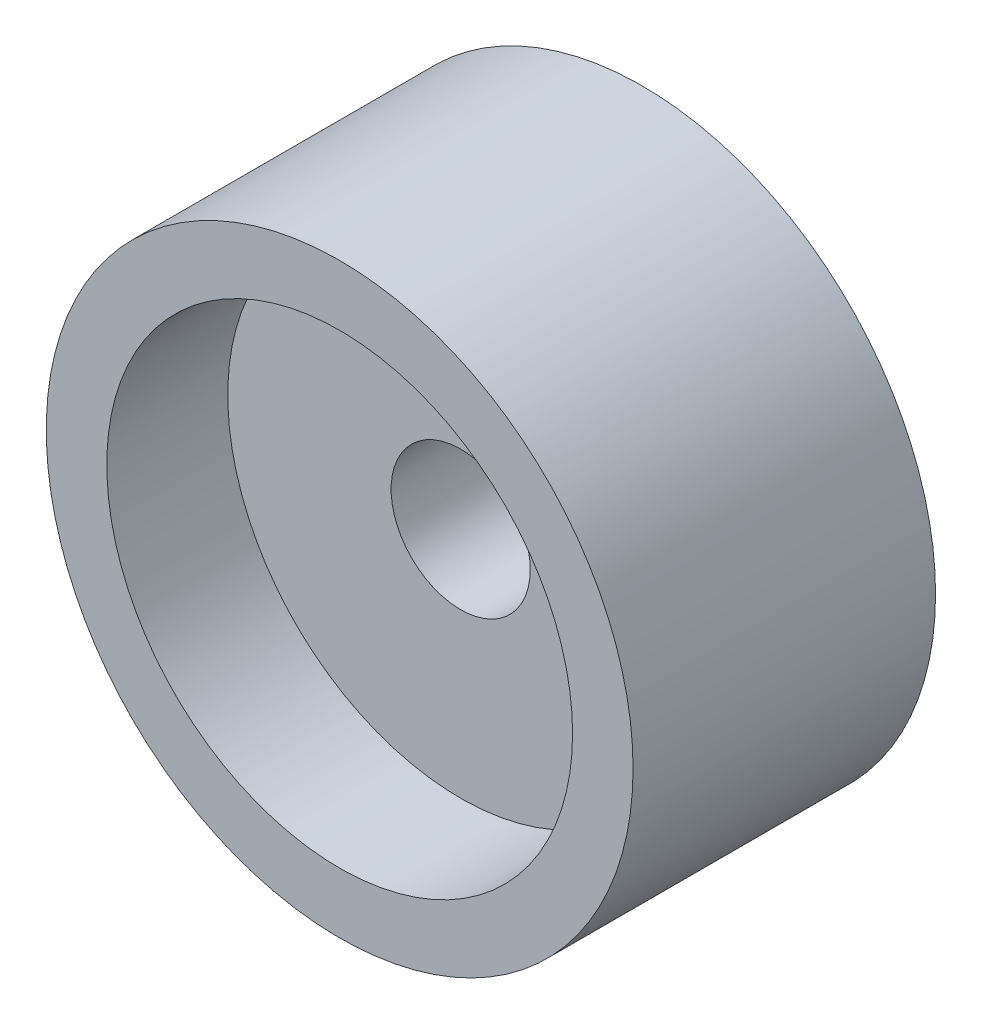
from build123d import *

# Parameters (mm, degrees)
SKETCH1_R           = 4.85
SKETCH1_R_2         = 3.85
BOSS_EXTRUDE1_DEPTH = 2
BOSS_EXTRUDE2_START = -3
SKETCH1_3_R         = 4.85
SKETCH1_3_R_2       = 3.85
SKETCH1_3_R_3       = 1.15
BOSS_EXTRUDE2_DEPTH = 3


with BuildPart() as part:
    # Sketch1 → Boss-Extrude1 (new body)
    with BuildSketch(Plane.XY):
        Circle(SKETCH1_R)
        Circle(SKETCH1_R_2, mode=Mode.SUBTRACT)
    extrude(amount=BOSS_EXTRUDE1_DEPTH)

    # Sketch1_3 → Boss-Extrude2 (add)
    # profile 1 of 2: a face of its own
    with BuildSketch(Plane.XY.offset(BOSS_EXTRUDE2_START)):
        Circle(SKETCH1_3_R)
        Circle(SKETCH1_3_R_2, mode=Mode.SUBTRACT)
    # profile 2 of 2: a face of its own
    with BuildSketch(Plane.XY.offset(BOSS_EXTRUDE2_START)):
        Circle(SKETCH1_3_R_2)
        Circle(SKETCH1_3_R_3, mode=Mode.SUBTRACT)
    extrude(amount=BOSS_EXTRUDE2_DEPTH)


solid = part.part
